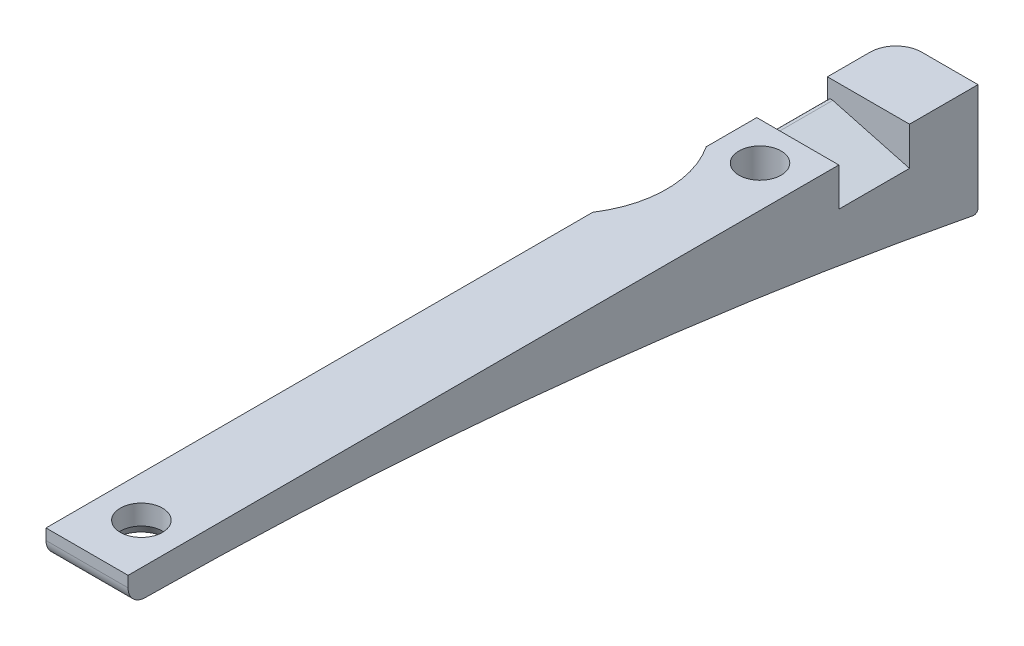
from build123d import *

# Parameters (mm, degrees)
EXTRUDE_1_DEPTH     = 3.8353999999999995
CUT_EXTRUDE_START   = -6.4008
CUT_EXTRUDE_1_DEPTH = 6.603999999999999
FILLET_1_R          = 0.396875
CUT_EXTRUDE_2_DEPTH = 81.19352385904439


with BuildPart() as part:
    # Sketch 1 → Extrude 1 (new, symmetric)
    with BuildSketch(Plane(origin=(0, 0, 0), x_dir=(0, 0, -1), z_dir=(1, 0, 0))):
        with BuildLine():
            Line((-79.4258, -1.0164979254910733), (-79.4258, 0))
            Line((-79.4258, 0), (0, 0))
            Line((0, 0), (1.23e-15, -10.003279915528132))
            ThreePointArc((1.23e-15, -10.003279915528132), (-0.13836672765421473, -10.297031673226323), (-0.4529663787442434, -10.37742138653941))
            ThreePointArc((-0.4529663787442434, -10.37742138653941), (-38.978803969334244, -4.749230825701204), (-77.85443020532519, -2.6039159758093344))
            ThreePointArc((-77.85443020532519, -2.6039159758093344), (-78.96652049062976, -2.133312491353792), (-79.4258, -1.0164979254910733))
        make_face()
    extrude(amount=EXTRUDE_1_DEPTH, both=True)

    # Sketch 2 → Cut-Extrude 1 (cut)
    with BuildSketch(Plane(origin=(0, 0, 0), x_dir=(-1, 0, 0), z_dir=(0, 1.2e-16, -1)).offset(CUT_EXTRUDE_START)):
        Polygon((-3.835399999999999, -3.579384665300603), (3.8353999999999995, -1.524), (3.8353999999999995, 0), (-3.8353999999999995, 0), align=None)
    extrude(amount=-CUT_EXTRUDE_1_DEPTH, mode=Mode.SUBTRACT)

    # Fillet 1
    fillet_1_edges = [part.edges().sort_by_distance(p)[0] for p in [
        (-3.8353999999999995, -1.5240000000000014, 9.7028),
    ]]
    fillet(fillet_1_edges, radius=FILLET_1_R)

    # Sketch 3 → Cut-Revolve 1 (revolve, cut)
    with BuildSketch(Plane(origin=(0, 0, 0), x_dir=(0, 0, -1), z_dir=(1, 0, 0)), mode=Mode.PRIVATE) as cut_revolve_1_sk:
        Polygon((-14.566899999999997, 6.6e-16), (-16.5354, 4.2e-16), (-16.5354, -8.0153039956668), (-13.867197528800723, -8.015303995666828), (-14.566899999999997, -6.803383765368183), align=None)
    revolve(cut_revolve_1_sk.sketch.rotate(Axis((0, 3.3928182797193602, 16.5354), (0, -1, 6.3e-16)), 315.073054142), axis=Axis((0, 3.3928182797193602, 16.5354), (0, -1, 6.3e-16)), mode=Mode.SUBTRACT)

    # Sketch 4 → Cut-Revolve 2 (revolve, cut)
    with BuildSketch(Plane(origin=(0, 0, 0), x_dir=(0, 0, -1), z_dir=(1, 0, 0)), mode=Mode.PRIVATE) as cut_revolve_2_sk:
        Polygon((-74.34579999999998, -1.73e-15), (-72.37729999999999, -1.59e-15), (-72.37729999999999, -1.86003481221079), (-71.88909519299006, -2.7056303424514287), (-74.34579999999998, -2.7056303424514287), align=None)
    revolve(cut_revolve_2_sk.sketch.rotate(Axis((0, 7.509342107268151, 74.34579999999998), (0, -1, 0)), 315.139990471), axis=Axis((0, 7.509342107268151, 74.34579999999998), (0, -1, 0)), mode=Mode.SUBTRACT)

    # Sketch 5 → Cut-Extrude 2 (cut, through all)
    with BuildSketch(Plane(origin=(0, 0, 0), x_dir=(1, 0, 0), z_dir=(0, 1, 0))):
        with BuildLine():
            Line((-3.835399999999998, -2.4130000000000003), (-3.8353999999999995, 0))
            Line((-3.8353999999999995, 0), (-1.4223999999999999, 0))
            ThreePointArc((-1.4223999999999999, 0), (-3.128648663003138, -0.7067513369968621), (-3.835399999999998, -2.4130000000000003))
        make_face()
    extrude(amount=-CUT_EXTRUDE_2_DEPTH, mode=Mode.SUBTRACT)

    # Sketch 6 → Cut-Revolve 3 (revolve, cut)
    with BuildSketch(Plane(origin=(0, -2.82e-15, 23.01875), x_dir=(-1, 0, 0), z_dir=(0, 1.2e-16, -1))):
        Polygon((2.2478999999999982, 7.8e-16), (11.816361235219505, 2.5638614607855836), (13.403861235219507, -3.3607691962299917), (3.835399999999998, -5.924630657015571), align=None)
    revolve(axis=Axis((-11.816361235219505, 2.5638614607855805, 23.01875), (-0.25881904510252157, -0.9659258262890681, 0)), mode=Mode.SUBTRACT)


solid = part.part
